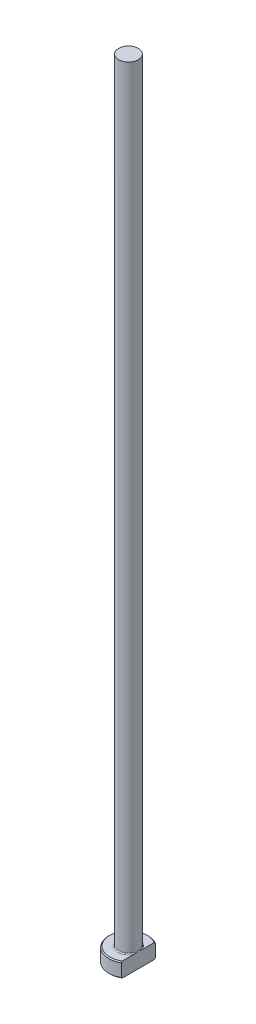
ISO-10303-21;
HEADER;
FILE_DESCRIPTION(('STEP AP214'),'2;1');
FILE_NAME('part.step','',(''),(''),'','','');
FILE_SCHEMA(('AUTOMOTIVE_DESIGN { 1 0 10303 214 1 1 1 1 }'));
ENDSEC;
DATA;
#1=APPLICATION_CONTEXT('core data for automotive mechanical design processes');
#2=APPLICATION_PROTOCOL_DEFINITION('international standard','automotive_design',2000,#1);
#3=PRODUCT_CONTEXT('',#1,'mechanical');
#4=PRODUCT('Part','Part','',(#3));
#5=PRODUCT_RELATED_PRODUCT_CATEGORY('part','',(#4));
#6=PRODUCT_DEFINITION_FORMATION('','',#4);
#7=PRODUCT_DEFINITION_CONTEXT('part definition',#1,'design');
#8=PRODUCT_DEFINITION('design','',#6,#7);
#9=PRODUCT_DEFINITION_SHAPE('','',#8);
#10=(LENGTH_UNIT() NAMED_UNIT(*) SI_UNIT(.MILLI.,.METRE.));
#11=(NAMED_UNIT(*) PLANE_ANGLE_UNIT() SI_UNIT($,.RADIAN.));
#12=(NAMED_UNIT(*) SI_UNIT($,.STERADIAN.) SOLID_ANGLE_UNIT());
#13=UNCERTAINTY_MEASURE_WITH_UNIT(LENGTH_MEASURE(1.E-05),#10,'distance_accuracy_value','');
#14=(GEOMETRIC_REPRESENTATION_CONTEXT(3) GLOBAL_UNCERTAINTY_ASSIGNED_CONTEXT((#13)) GLOBAL_UNIT_ASSIGNED_CONTEXT((#10,
#11,#12)) REPRESENTATION_CONTEXT('',''));
#15=CARTESIAN_POINT('',(0.,0.,0.));
#16=DIRECTION('',(0.,0.,1.));
#17=DIRECTION('',(1.,0.,0.));
#18=AXIS2_PLACEMENT_3D('',#15,#16,#17);
#19=CARTESIAN_POINT('',(0.,0.,0.));
#20=DIRECTION('',(0.,-1.,0.));
#21=DIRECTION('',(0.,0.,-1.));
#22=AXIS2_PLACEMENT_3D('',#19,#20,#21);
#23=PLANE('',#22);
#24=CARTESIAN_POINT('',(0.,0.,0.));
#25=DIRECTION('',(0.,-1.,0.));
#26=DIRECTION('',(0.,0.,-1.));
#27=AXIS2_PLACEMENT_3D('',#24,#25,#26);
#28=CIRCLE('',#27,3.80000000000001);
#29=CARTESIAN_POINT('',(1.99999999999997,0.,3.23109888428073));
#30=VERTEX_POINT('',#29);
#31=CARTESIAN_POINT('',(1.99999999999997,0.,-3.23109888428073));
#32=VERTEX_POINT('',#31);
#33=EDGE_CURVE('E98',#30,#32,#28,.T.);
#34=ORIENTED_EDGE('',*,*,#33,.T.);
#35=DIRECTION('',(0.,0.,1.));
#36=VECTOR('',#35,1.);
#37=CARTESIAN_POINT('',(1.99999999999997,0.,-3.46410161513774));
#38=LINE('',#37,#36);
#39=EDGE_CURVE('E83',#32,#30,#38,.T.);
#40=ORIENTED_EDGE('',*,*,#39,.T.);
#41=EDGE_LOOP('',(#34,#40));
#42=FACE_BOUND('',#41,.T.);
#43=ADVANCED_FACE('F32',(#42),#23,.T.);
#44=CARTESIAN_POINT('',(0.,259.958771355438,0.));
#45=DIRECTION('',(0.,1.,0.));
#46=DIRECTION('',(0.,0.,1.));
#47=AXIS2_PLACEMENT_3D('',#44,#45,#46);
#48=CYLINDRICAL_SURFACE('',#47,3.99999999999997);
#49=CARTESIAN_POINT('',(0.,2.79999999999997,0.));
#50=DIRECTION('',(0.,1.,0.));
#51=DIRECTION('',(0.,0.,1.));
#52=AXIS2_PLACEMENT_3D('',#49,#50,#51);
#53=CIRCLE('',#52,3.99999999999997);
#54=CARTESIAN_POINT('',(1.99999999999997,2.79999999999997,3.46410161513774));
#55=VERTEX_POINT('',#54);
#56=CARTESIAN_POINT('',(1.99999999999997,2.79999999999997,-3.46410161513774));
#57=VERTEX_POINT('',#56);
#58=EDGE_CURVE('E104',#55,#57,#53,.F.);
#59=ORIENTED_EDGE('',*,*,#58,.T.);
#60=DIRECTION('',(0.,-1.,0.));
#61=VECTOR('',#60,1.);
#62=CARTESIAN_POINT('',(1.99999999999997,160.,-3.46410161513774));
#63=LINE('',#62,#61);
#64=CARTESIAN_POINT('',(1.99999999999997,0.199999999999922,-3.46410161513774));
#65=VERTEX_POINT('',#64);
#66=EDGE_CURVE('E183',#57,#65,#63,.T.);
#67=ORIENTED_EDGE('',*,*,#66,.T.);
#68=CARTESIAN_POINT('',(0.,0.199999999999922,0.));
#69=DIRECTION('',(0.,-1.,0.));
#70=DIRECTION('',(0.,0.,-1.));
#71=AXIS2_PLACEMENT_3D('',#68,#69,#70);
#72=CIRCLE('',#71,3.99999999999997);
#73=CARTESIAN_POINT('',(1.99999999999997,0.199999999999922,3.46410161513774));
#74=VERTEX_POINT('',#73);
#75=EDGE_CURVE('E100',#65,#74,#72,.F.);
#76=ORIENTED_EDGE('',*,*,#75,.T.);
#77=DIRECTION('',(0.,-1.,0.));
#78=VECTOR('',#77,1.);
#79=CARTESIAN_POINT('',(1.99999999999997,160.,3.46410161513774));
#80=LINE('',#79,#78);
#81=EDGE_CURVE('E93',#55,#74,#80,.T.);
#82=ORIENTED_EDGE('',*,*,#81,.F.);
#83=EDGE_LOOP('',(#59,#67,#76,#82));
#84=FACE_BOUND('',#83,.T.);
#85=ADVANCED_FACE('F158',(#84),#48,.T.);
#86=CARTESIAN_POINT('',(-3.99999999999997,3.,0.));
#87=DIRECTION('',(0.,1.,0.));
#88=DIRECTION('',(0.,0.,1.));
#89=AXIS2_PLACEMENT_3D('',#86,#87,#88);
#90=PLANE('',#89);
#91=CARTESIAN_POINT('',(0.,3.,0.));
#92=DIRECTION('',(0.,1.,0.));
#93=DIRECTION('',(0.,0.,1.));
#94=AXIS2_PLACEMENT_3D('',#91,#92,#93);
#95=CIRCLE('',#94,3.79999999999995);
#96=CARTESIAN_POINT('',(1.99999999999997,3.,-3.23109888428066));
#97=VERTEX_POINT('',#96);
#98=CARTESIAN_POINT('',(1.99999999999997,3.,3.23109888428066));
#99=VERTEX_POINT('',#98);
#100=EDGE_CURVE('E178',#97,#99,#95,.T.);
#101=ORIENTED_EDGE('',*,*,#100,.T.);
#102=DIRECTION('',(0.,0.,-1.));
#103=VECTOR('',#102,1.);
#104=CARTESIAN_POINT('',(1.99999999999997,3.,0.));
#105=LINE('',#104,#103);
#106=CARTESIAN_POINT('',(1.99999999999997,2.99999999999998,0.916515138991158));
#107=VERTEX_POINT('',#106);
#108=EDGE_CURVE('E57',#99,#107,#105,.T.);
#109=ORIENTED_EDGE('',*,*,#108,.T.);
#110=CARTESIAN_POINT('',(0.,3.,0.));
#111=DIRECTION('',(0.,1.,0.));
#112=DIRECTION('',(0.,0.,1.));
#113=AXIS2_PLACEMENT_3D('',#110,#111,#112);
#114=CIRCLE('',#113,2.19999999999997);
#115=CARTESIAN_POINT('',(1.99999999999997,2.99999999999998,-0.9165151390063));
#116=VERTEX_POINT('',#115);
#117=EDGE_CURVE('E107',#107,#116,#114,.F.);
#118=ORIENTED_EDGE('',*,*,#117,.T.);
#119=EDGE_CURVE('E136',#116,#97,#105,.T.);
#120=ORIENTED_EDGE('',*,*,#119,.T.);
#121=EDGE_LOOP('',(#101,#109,#118,#120));
#122=FACE_BOUND('',#121,.T.);
#123=ADVANCED_FACE('F147',(#122),#90,.T.);
#124=CARTESIAN_POINT('',(0.,3.,0.));
#125=DIRECTION('',(0.,-1.,0.));
#126=DIRECTION('',(0.,0.,-1.));
#127=AXIS2_PLACEMENT_3D('',#124,#125,#126);
#128=CONICAL_SURFACE('',#127,3.79999999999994,0.785398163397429);
#129=ORIENTED_EDGE('',*,*,#58,.F.);
#130=CARTESIAN_POINT('',(1.99999999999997,-1.08095467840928,7.62295524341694));
#131=CARTESIAN_POINT('',(1.99999999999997,-0.913887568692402,7.45022392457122));
#132=CARTESIAN_POINT('',(1.99999999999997,-0.746999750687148,7.27731861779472));
#133=CARTESIAN_POINT('',(1.99999999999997,-0.413688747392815,6.93105655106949));
#134=CARTESIAN_POINT('',(1.99999999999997,-0.247265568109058,6.75769978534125));
#135=CARTESIAN_POINT('',(1.99999999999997,0.0850908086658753,6.41034692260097));
#136=CARTESIAN_POINT('',(1.99999999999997,0.251023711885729,6.23635054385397));
#137=CARTESIAN_POINT('',(1.99999999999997,0.582155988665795,5.88766284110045));
#138=CARTESIAN_POINT('',(1.99999999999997,0.747355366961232,5.71297152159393));
#139=CARTESIAN_POINT('',(1.99999999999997,1.07353855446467,5.36616839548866));
#140=CARTESIAN_POINT('',(1.99999999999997,1.23454099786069,5.194074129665));
#141=CARTESIAN_POINT('',(1.99999999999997,1.5553410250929,4.84876663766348));
#142=CARTESIAN_POINT('',(1.99999999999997,1.71513861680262,4.67555341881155));
#143=CARTESIAN_POINT('',(1.99999999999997,2.03306183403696,4.32766569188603));
#144=CARTESIAN_POINT('',(1.99999999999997,2.19118781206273,4.15299150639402));
#145=CARTESIAN_POINT('',(1.99999999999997,2.50513944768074,3.80159134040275));
#146=CARTESIAN_POINT('',(1.99999999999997,2.6609651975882,3.62486544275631));
#147=CARTESIAN_POINT('',(1.99999999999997,2.90974646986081,3.33722425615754));
#148=CARTESIAN_POINT('',(1.99999999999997,3.00376148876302,3.22722645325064));
#149=CARTESIAN_POINT('',(1.99999999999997,3.19011825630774,3.00579987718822));
#150=CARTESIAN_POINT('',(1.99999999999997,3.28245983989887,2.89437096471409));
#151=CARTESIAN_POINT('',(1.99999999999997,3.46586188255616,2.66849662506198));
#152=CARTESIAN_POINT('',(1.99999999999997,3.55689849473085,2.55403176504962));
#153=CARTESIAN_POINT('',(1.99999999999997,3.73578809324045,2.32266819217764));
#154=CARTESIAN_POINT('',(1.99999999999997,3.82364184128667,2.20577007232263));
#155=CARTESIAN_POINT('',(1.99999999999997,3.99612756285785,1.96688707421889));
#156=CARTESIAN_POINT('',(1.99999999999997,4.08069035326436,1.84485190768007));
#157=CARTESIAN_POINT('',(1.99999999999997,4.24300264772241,1.59599329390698));
#158=CARTESIAN_POINT('',(1.99999999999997,4.32074277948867,1.46916359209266));
#159=CARTESIAN_POINT('',(1.99999999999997,4.42869763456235,1.27510066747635));
#160=CARTESIAN_POINT('',(1.99999999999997,4.46305374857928,1.21018943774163));
#161=CARTESIAN_POINT('',(1.99999999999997,4.52837146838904,1.07868835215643));
#162=CARTESIAN_POINT('',(1.99999999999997,4.55933245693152,1.01209819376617));
#163=CARTESIAN_POINT('',(1.99999999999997,4.64566860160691,0.809894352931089));
#164=CARTESIAN_POINT('',(1.99999999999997,4.69478214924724,0.67136024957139));
#165=CARTESIAN_POINT('',(1.99999999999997,4.74794829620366,0.463657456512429));
#166=CARTESIAN_POINT('',(1.99999999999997,4.76205065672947,0.397033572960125));
#167=CARTESIAN_POINT('',(1.99999999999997,4.7839037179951,0.262728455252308));
#168=CARTESIAN_POINT('',(1.99999999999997,4.79165498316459,0.195047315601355));
#169=CARTESIAN_POINT('',(1.99999999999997,4.80025690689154,0.0594528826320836));
#170=CARTESIAN_POINT('',(1.99999999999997,4.80112894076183,-0.00845903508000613));
#171=CARTESIAN_POINT('',(1.99999999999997,4.79596585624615,-0.144020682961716));
#172=CARTESIAN_POINT('',(1.99999999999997,4.7899301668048,-0.211670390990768));
#173=CARTESIAN_POINT('',(1.99999999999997,4.77145363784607,-0.34548399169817));
#174=CARTESIAN_POINT('',(1.99999999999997,4.75906777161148,-0.411655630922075));
#175=CARTESIAN_POINT('',(1.99999999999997,4.72866360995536,-0.542678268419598));
#176=CARTESIAN_POINT('',(1.99999999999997,4.71064463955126,-0.607529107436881));
#177=CARTESIAN_POINT('',(1.99999999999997,4.66972939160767,-0.736064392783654));
#178=CARTESIAN_POINT('',(1.99999999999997,4.6468056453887,-0.799739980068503));
#179=CARTESIAN_POINT('',(1.99999999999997,4.59700147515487,-0.925489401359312));
#180=CARTESIAN_POINT('',(1.99999999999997,4.57012185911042,-0.98756355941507));
#181=CARTESIAN_POINT('',(1.99999999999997,4.48443518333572,-1.17209020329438));
#182=CARTESIAN_POINT('',(1.99999999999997,4.42077407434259,-1.29228210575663));
#183=CARTESIAN_POINT('',(1.99999999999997,4.28502644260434,-1.52785770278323));
#184=CARTESIAN_POINT('',(1.99999999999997,4.21292931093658,-1.64323509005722));
#185=CARTESIAN_POINT('',(1.99999999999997,4.0628151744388,-1.87069387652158));
#186=CARTESIAN_POINT('',(1.99999999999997,3.98477595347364,-1.98276048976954));
#187=CARTESIAN_POINT('',(1.99999999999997,3.82481971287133,-2.20397837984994));
#188=CARTESIAN_POINT('',(1.99999999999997,3.74290465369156,-2.31313108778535));
#189=CARTESIAN_POINT('',(1.99999999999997,3.57517222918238,-2.5306854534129));
#190=CARTESIAN_POINT('',(1.99999999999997,3.48931769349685,-2.63905831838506));
#191=CARTESIAN_POINT('',(1.99999999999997,3.31548151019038,-2.85409686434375));
#192=CARTESIAN_POINT('',(1.99999999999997,3.22749963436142,-2.96076236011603));
#193=CARTESIAN_POINT('',(1.99999999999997,3.05015030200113,-3.17249211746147));
#194=CARTESIAN_POINT('',(1.99999999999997,2.96078672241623,-3.27755963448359));
#195=CARTESIAN_POINT('',(1.99999999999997,2.78082366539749,-3.48663191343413));
#196=CARTESIAN_POINT('',(1.99999999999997,2.69022416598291,-3.59063665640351));
#197=CARTESIAN_POINT('',(1.99999999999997,2.4479673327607,-3.86612439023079));
#198=CARTESIAN_POINT('',(1.99999999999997,2.29545972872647,-4.03685912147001));
#199=CARTESIAN_POINT('',(1.99999999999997,1.98858070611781,-4.37664803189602));
#200=CARTESIAN_POINT('',(1.99999999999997,1.8342092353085,-4.54570216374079));
#201=CARTESIAN_POINT('',(1.99999999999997,1.52396102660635,-4.88271638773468));
#202=CARTESIAN_POINT('',(1.99999999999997,1.3680830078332,-5.05067529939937));
#203=CARTESIAN_POINT('',(1.99999999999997,1.05530513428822,-5.38563883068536));
#204=CARTESIAN_POINT('',(1.99999999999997,0.898405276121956,-5.55264344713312));
#205=CARTESIAN_POINT('',(1.99999999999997,0.590290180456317,-5.87905385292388));
#206=CARTESIAN_POINT('',(1.99999999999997,0.439106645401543,-6.03848959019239));
#207=CARTESIAN_POINT('',(1.99999999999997,0.136164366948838,-6.356814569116));
#208=CARTESIAN_POINT('',(1.99999999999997,-0.0155943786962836,-6.51570380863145));
#209=CARTESIAN_POINT('',(1.99999999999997,-0.31940498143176,-6.83286192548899));
#210=CARTESIAN_POINT('',(1.99999999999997,-0.471456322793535,-6.99113129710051));
#211=CARTESIAN_POINT('',(1.99999999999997,-0.77593964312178,-7.30730102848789));
#212=CARTESIAN_POINT('',(1.99999999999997,-0.928371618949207,-7.46520139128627));
#213=CARTESIAN_POINT('',(1.99999999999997,-1.08095467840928,-7.62295524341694));
#214=B_SPLINE_CURVE_WITH_KNOTS('',3,(#130,#131,#132,#133,#134,#135,#136,#137,#138,#139,#140,
#141,#142,#143,#144,#145,#146,#147,#148,#149,#150,#151,#152,#153,#154,#155,#156,#157,#158,#159,
#160,#161,#162,#163,#164,#165,#166,#167,#168,#169,#170,#171,#172,#173,#174,#175,#176,#177,#178,
#179,#180,#181,#182,#183,#184,#185,#186,#187,#188,#189,#190,#191,#192,#193,#194,#195,#196,#197,
#198,#199,#200,#201,#202,#203,#204,#205,#206,#207,#208,#209,#210,#211,#212,#213),.UNSPECIFIED.,
.F.,.F.,(4,2,2,2,2,2,2,2,2,2,2,2,2,2,2,2,2,2,2,2,2,2,2,2,2,2,2,2,2,2,2,2,2,2,2,2,2,2,2,2,2,4),
(0.,0.720921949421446,1.44185317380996,2.1631532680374,2.88444869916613,3.59144103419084,
4.29842874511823,5.005264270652,5.712071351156,6.14616174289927,6.58029471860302,
7.01901494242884,7.45762947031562,7.90290456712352,8.34878206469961,8.56901415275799,
8.7892862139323,9.22814472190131,9.43219512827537,9.63622739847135,9.8396254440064,
10.0430403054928,10.2447232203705,10.4464303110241,10.6492980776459,10.8521244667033,
11.259558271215,11.6675100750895,12.0770700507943,12.4864250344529,12.901167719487,
13.3159550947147,13.7297367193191,14.1435257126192,14.8302935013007,15.5170805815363,
16.2045145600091,16.8919508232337,17.5511045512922,18.2102608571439,18.86868195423,
19.5270976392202),.UNSPECIFIED.);
#215=EDGE_CURVE('E135',#55,#99,#214,.T.);
#216=ORIENTED_EDGE('',*,*,#215,.T.);
#217=ORIENTED_EDGE('',*,*,#100,.F.);
#218=EDGE_CURVE('E127',#97,#57,#214,.T.);
#219=ORIENTED_EDGE('',*,*,#218,.T.);
#220=EDGE_LOOP('',(#129,#216,#217,#219));
#221=FACE_BOUND('',#220,.T.);
#222=ADVANCED_FACE('F143',(#221),#128,.T.);
#223=CARTESIAN_POINT('',(0.,0.199999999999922,0.));
#224=DIRECTION('',(0.,1.,0.));
#225=DIRECTION('',(0.,0.,1.));
#226=AXIS2_PLACEMENT_3D('',#223,#224,#225);
#227=CONICAL_SURFACE('',#226,3.99999999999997,0.785398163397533);
#228=ORIENTED_EDGE('',*,*,#75,.F.);
#229=CARTESIAN_POINT('',(1.99999999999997,4.08095467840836,-7.62295524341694));
#230=CARTESIAN_POINT('',(1.99999999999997,3.91388756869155,-7.45022392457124));
#231=CARTESIAN_POINT('',(1.99999999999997,3.74699975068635,-7.27731861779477));
#232=CARTESIAN_POINT('',(1.99999999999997,3.41368874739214,-6.9310565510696));
#233=CARTESIAN_POINT('',(1.99999999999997,3.24726556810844,-6.75769978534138));
#234=CARTESIAN_POINT('',(1.99999999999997,2.91490919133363,-6.41034692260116));
#235=CARTESIAN_POINT('',(1.99999999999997,2.74897628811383,-6.23635054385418));
#236=CARTESIAN_POINT('',(1.99999999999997,2.41784401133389,-5.88766284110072));
#237=CARTESIAN_POINT('',(1.99999999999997,2.25264463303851,-5.71297152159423));
#238=CARTESIAN_POINT('',(1.99999999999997,1.92646144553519,-5.36616839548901));
#239=CARTESIAN_POINT('',(1.99999999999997,1.76545900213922,-5.19407412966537));
#240=CARTESIAN_POINT('',(1.99999999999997,1.44465897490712,-4.84876663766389));
#241=CARTESIAN_POINT('',(1.99999999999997,1.28486138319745,-4.67555341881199));
#242=CARTESIAN_POINT('',(1.99999999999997,0.966938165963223,-4.32766569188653));
#243=CARTESIAN_POINT('',(1.99999999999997,0.808812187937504,-4.15299150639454));
#244=CARTESIAN_POINT('',(1.99999999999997,0.494860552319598,-3.80159134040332));
#245=CARTESIAN_POINT('',(1.99999999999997,0.339034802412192,-3.62486544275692));
#246=CARTESIAN_POINT('',(1.99999999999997,0.0902535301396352,-3.33722425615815));
#247=CARTESIAN_POINT('',(1.99999999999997,-0.00376148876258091,-3.22722645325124));
#248=CARTESIAN_POINT('',(1.99999999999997,-0.190118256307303,-3.00579987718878));
#249=CARTESIAN_POINT('',(1.99999999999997,-0.282459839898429,-2.89437096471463));
#250=CARTESIAN_POINT('',(1.99999999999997,-0.46586188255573,-2.66849662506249));
#251=CARTESIAN_POINT('',(1.99999999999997,-0.556898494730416,-2.55403176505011));
#252=CARTESIAN_POINT('',(1.99999999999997,-0.73578809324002,-2.3226681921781));
#253=CARTESIAN_POINT('',(1.99999999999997,-0.823641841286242,-2.20577007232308));
#254=CARTESIAN_POINT('',(1.99999999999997,-0.99612756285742,-1.9668870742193));
#255=CARTESIAN_POINT('',(1.99999999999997,-1.08069035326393,-1.84485190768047));
#256=CARTESIAN_POINT('',(1.99999999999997,-1.24300264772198,-1.59599329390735));
#257=CARTESIAN_POINT('',(1.99999999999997,-1.32074277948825,-1.46916359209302));
#258=CARTESIAN_POINT('',(1.99999999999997,-1.42869763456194,-1.27510066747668));
#259=CARTESIAN_POINT('',(1.99999999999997,-1.46305374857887,-1.21018943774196));
#260=CARTESIAN_POINT('',(1.99999999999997,-1.52837146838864,-1.07868835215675));
#261=CARTESIAN_POINT('',(1.99999999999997,-1.55933245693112,-1.01209819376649));
#262=CARTESIAN_POINT('',(1.99999999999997,-1.64566860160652,-0.809894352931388));
#263=CARTESIAN_POINT('',(1.99999999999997,-1.69478214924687,-0.671360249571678));
#264=CARTESIAN_POINT('',(1.99999999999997,-1.7479482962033,-0.463657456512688));
#265=CARTESIAN_POINT('',(1.99999999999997,-1.76205065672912,-0.397033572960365));
#266=CARTESIAN_POINT('',(1.99999999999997,-1.78390371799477,-0.262728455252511));
#267=CARTESIAN_POINT('',(1.99999999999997,-1.79165498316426,-0.195047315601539));
#268=CARTESIAN_POINT('',(1.99999999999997,-1.80025690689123,-0.0594528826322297));
#269=CARTESIAN_POINT('',(1.99999999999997,-1.80112894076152,0.00845903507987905));
#270=CARTESIAN_POINT('',(1.99999999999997,-1.79596585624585,0.144020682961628));
#271=CARTESIAN_POINT('',(1.99999999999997,-1.78993016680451,0.2116703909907));
#272=CARTESIAN_POINT('',(1.99999999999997,-1.77145363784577,0.345483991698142));
#273=CARTESIAN_POINT('',(1.99999999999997,-1.75906777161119,0.411655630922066));
#274=CARTESIAN_POINT('',(1.99999999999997,-1.72866360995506,0.542678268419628));
#275=CARTESIAN_POINT('',(1.99999999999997,-1.71064463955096,0.607529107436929));
#276=CARTESIAN_POINT('',(1.99999999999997,-1.66972939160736,0.736064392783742));
#277=CARTESIAN_POINT('',(1.99999999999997,-1.64680564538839,0.799739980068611));
#278=CARTESIAN_POINT('',(1.99999999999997,-1.59700147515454,0.925489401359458));
#279=CARTESIAN_POINT('',(1.99999999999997,-1.57012185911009,0.987563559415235));
#280=CARTESIAN_POINT('',(1.99999999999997,-1.48443518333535,1.17209020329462));
#281=CARTESIAN_POINT('',(1.99999999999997,-1.4207740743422,1.29228210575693));
#282=CARTESIAN_POINT('',(1.99999999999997,-1.28502644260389,1.52785770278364));
#283=CARTESIAN_POINT('',(1.99999999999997,-1.2129293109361,1.64323509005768));
#284=CARTESIAN_POINT('',(1.99999999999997,-1.06281517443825,1.87069387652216));
#285=CARTESIAN_POINT('',(1.99999999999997,-0.984775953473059,1.98276048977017));
#286=CARTESIAN_POINT('',(1.99999999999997,-0.824819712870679,2.20397837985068));
#287=CARTESIAN_POINT('',(1.99999999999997,-0.74290465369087,2.31313108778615));
#288=CARTESIAN_POINT('',(1.99999999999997,-0.575172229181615,2.5306854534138));
#289=CARTESIAN_POINT('',(1.99999999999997,-0.489317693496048,2.63905831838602));
#290=CARTESIAN_POINT('',(1.99999999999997,-0.315481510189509,2.85409686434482));
#291=CARTESIAN_POINT('',(1.99999999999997,-0.227499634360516,2.96076236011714));
#292=CARTESIAN_POINT('',(1.99999999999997,-0.0501503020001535,3.1724921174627));
#293=CARTESIAN_POINT('',(1.99999999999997,0.0392132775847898,3.27755963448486));
#294=CARTESIAN_POINT('',(1.99999999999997,0.219176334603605,3.48663191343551));
#295=CARTESIAN_POINT('',(1.99999999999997,0.309775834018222,3.59063665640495));
#296=CARTESIAN_POINT('',(1.99999999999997,0.55203266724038,3.86612439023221));
#297=CARTESIAN_POINT('',(1.99999999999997,0.704540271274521,4.03685912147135));
#298=CARTESIAN_POINT('',(1.99999999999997,1.011419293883,4.37664803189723));
#299=CARTESIAN_POINT('',(1.99999999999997,1.16579076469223,4.54570216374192));
#300=CARTESIAN_POINT('',(1.99999999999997,1.4760389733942,4.88271638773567));
#301=CARTESIAN_POINT('',(1.99999999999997,1.63191699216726,5.0506752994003));
#302=CARTESIAN_POINT('',(1.99999999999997,1.94469486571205,5.38563883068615));
#303=CARTESIAN_POINT('',(1.99999999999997,2.10159472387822,5.55264344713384));
#304=CARTESIAN_POINT('',(1.99999999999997,2.40970981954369,5.87905385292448));
#305=CARTESIAN_POINT('',(1.99999999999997,2.56089335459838,6.03848959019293));
#306=CARTESIAN_POINT('',(1.99999999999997,2.86383563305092,6.35681456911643));
#307=CARTESIAN_POINT('',(1.99999999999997,3.01559437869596,6.51570380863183));
#308=CARTESIAN_POINT('',(1.99999999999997,3.31940498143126,6.83286192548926));
#309=CARTESIAN_POINT('',(1.99999999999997,3.47145632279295,6.99113129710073));
#310=CARTESIAN_POINT('',(1.99999999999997,3.77593964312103,7.307301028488));
#311=CARTESIAN_POINT('',(1.99999999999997,3.92837161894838,7.46520139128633));
#312=CARTESIAN_POINT('',(1.99999999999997,4.08095467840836,7.62295524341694));
#313=B_SPLINE_CURVE_WITH_KNOTS('',3,(#229,#230,#231,#232,#233,#234,#235,#236,#237,#238,#239,
#240,#241,#242,#243,#244,#245,#246,#247,#248,#249,#250,#251,#252,#253,#254,#255,#256,#257,#258,
#259,#260,#261,#262,#263,#264,#265,#266,#267,#268,#269,#270,#271,#272,#273,#274,#275,#276,#277,
#278,#279,#280,#281,#282,#283,#284,#285,#286,#287,#288,#289,#290,#291,#292,#293,#294,#295,#296,
#297,#298,#299,#300,#301,#302,#303,#304,#305,#306,#307,#308,#309,#310,#311,#312),.UNSPECIFIED.,
.F.,.F.,(4,2,2,2,2,2,2,2,2,2,2,2,2,2,2,2,2,2,2,2,2,2,2,2,2,2,2,2,2,2,2,2,2,2,2,2,2,2,2,2,2,4),
(0.,0.720921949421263,1.4418531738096,2.16315326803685,2.8844486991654,3.59144103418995,
4.29842874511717,5.00526427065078,5.71207135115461,6.14616174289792,6.58029471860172,
7.01901494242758,7.4576294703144,7.90290456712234,8.34878206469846,8.56901415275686,
8.78928621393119,9.22814472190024,9.43219512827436,9.6362273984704,9.83962544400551,
10.043040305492,10.2447232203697,10.4464303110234,10.6492980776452,10.8521244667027,
11.2595582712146,11.6675100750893,12.0770700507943,12.4864250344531,12.9011677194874,
13.3159550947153,13.7297367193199,14.1435257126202,14.8302935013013,15.5170805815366,
16.204514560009,16.8919508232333,17.5511045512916,18.2102608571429,18.8686819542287,
19.5270976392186),.UNSPECIFIED.);
#314=EDGE_CURVE('E86',#65,#32,#313,.T.);
#315=ORIENTED_EDGE('',*,*,#314,.T.);
#316=ORIENTED_EDGE('',*,*,#33,.F.);
#317=EDGE_CURVE('E89',#30,#74,#313,.T.);
#318=ORIENTED_EDGE('',*,*,#317,.T.);
#319=EDGE_LOOP('',(#228,#315,#316,#318));
#320=FACE_BOUND('',#319,.T.);
#321=ADVANCED_FACE('F97',(#320),#227,.T.);
#322=CARTESIAN_POINT('',(0.,3.19999999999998,0.));
#323=DIRECTION('',(0.,1.,0.));
#324=DIRECTION('',(0.,0.,1.));
#325=AXIS2_PLACEMENT_3D('',#322,#323,#324);
#326=TOROIDAL_SURFACE('',#325,2.19999999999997,0.2);
#327=CARTESIAN_POINT('',(1.99999999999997,3.19999999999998,0.));
#328=CARTESIAN_POINT('',(1.99999999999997,3.20000050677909,1.13930257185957E-10));
#329=CARTESIAN_POINT('',(1.99999999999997,3.20000101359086,-1.46766790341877E-07));
#330=CARTESIAN_POINT('',(1.99999999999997,3.20000197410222,-5.82067439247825E-07));
#331=CARTESIAN_POINT('',(1.99999999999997,3.20000242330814,-8.77873003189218E-07));
#332=CARTESIAN_POINT('',(1.99999999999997,3.20000333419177,-1.58424512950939E-06));
#333=CARTESIAN_POINT('',(1.99999999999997,3.20000378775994,-2.00534281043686E-06));
#334=CARTESIAN_POINT('',(1.99999999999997,3.20000462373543,-2.89558838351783E-06));
#335=CARTESIAN_POINT('',(1.99999999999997,3.20000500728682,-3.3637232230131E-06));
#336=CARTESIAN_POINT('',(1.99999999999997,3.20000636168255,-5.10887545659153E-06));
#337=CARTESIAN_POINT('',(1.99999999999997,3.2000072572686,-6.44597273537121E-06));
#338=CARTESIAN_POINT('',(1.99999999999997,3.20000879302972,-9.14926709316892E-06));
#339=CARTESIAN_POINT('',(1.99999999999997,3.20000944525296,-1.05089714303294E-05));
#340=CARTESIAN_POINT('',(1.99999999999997,3.20001204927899,-1.60555879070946E-05));
#341=CARTESIAN_POINT('',(1.99999999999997,3.20001390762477,-2.02908746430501E-05));
#342=CARTESIAN_POINT('',(1.99999999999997,3.20001676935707,-2.84438492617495E-05));
#343=CARTESIAN_POINT('',(1.99999999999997,3.2000178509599,-3.23343257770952E-05));
#344=CARTESIAN_POINT('',(1.99999999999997,3.20002551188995,-6.06027142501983E-05));
#345=CARTESIAN_POINT('',(1.99999999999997,3.20003111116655,-8.51991843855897E-05));
#346=CARTESIAN_POINT('',(1.99999999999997,3.20005559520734,-0.000181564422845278));
#347=CARTESIAN_POINT('',(1.99999999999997,3.20007914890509,-0.00025209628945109));
#348=CARTESIAN_POINT('',(1.99999999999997,3.20017002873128,-0.000529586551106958));
#349=CARTESIAN_POINT('',(1.99999999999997,3.20023415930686,-0.000737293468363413));
#350=CARTESIAN_POINT('',(1.99999999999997,3.20048926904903,-0.00155657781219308));
#351=CARTESIAN_POINT('',(1.99999999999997,3.20068414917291,-0.00216722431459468));
#352=CARTESIAN_POINT('',(1.99999999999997,3.20148805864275,-0.00469384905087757));
#353=CARTESIAN_POINT('',(1.99999999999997,3.20209226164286,-0.00661098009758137));
#354=CARTESIAN_POINT('',(1.99999999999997,3.20822779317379,-0.026069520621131));
#355=CARTESIAN_POINT('',(1.99999999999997,3.21378174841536,-0.0436057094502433));
#356=CARTESIAN_POINT('',(1.99999999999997,3.22462834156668,-0.0780127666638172));
#357=CARTESIAN_POINT('',(1.99999999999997,3.2299227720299,-0.0948831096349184));
#358=CARTESIAN_POINT('',(1.99999999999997,3.24110477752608,-0.130713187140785));
#359=CARTESIAN_POINT('',(1.99999999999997,3.24698536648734,-0.149675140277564));
#360=CARTESIAN_POINT('',(1.99999999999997,3.2586983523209,-0.187834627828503));
#361=CARTESIAN_POINT('',(1.99999999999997,3.26452957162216,-0.207032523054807));
#362=CARTESIAN_POINT('',(1.99999999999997,3.27861584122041,-0.254071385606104));
#363=CARTESIAN_POINT('',(1.99999999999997,3.28678835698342,-0.281937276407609));
#364=CARTESIAN_POINT('',(1.99999999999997,3.30249503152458,-0.337115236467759));
#365=CARTESIAN_POINT('',(1.99999999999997,3.31003989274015,-0.36442425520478));
#366=CARTESIAN_POINT('',(1.99999999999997,3.32554795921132,-0.422841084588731));
#367=CARTESIAN_POINT('',(1.99999999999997,3.33343288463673,-0.453970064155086));
#368=CARTESIAN_POINT('',(1.99999999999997,3.34833120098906,-0.516667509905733));
#369=CARTESIAN_POINT('',(1.99999999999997,3.3553379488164,-0.548237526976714));
#370=CARTESIAN_POINT('',(1.99999999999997,3.37554978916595,-0.647984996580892));
#371=CARTESIAN_POINT('',(1.99999999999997,3.38665117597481,-0.716635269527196));
#372=CARTESIAN_POINT('',(1.99999999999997,3.39785773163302,-0.832445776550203));
#373=CARTESIAN_POINT('',(1.99999999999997,3.40036304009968,-0.879345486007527));
#374=CARTESIAN_POINT('',(1.99999999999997,3.3997602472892,-0.94923898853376));
#375=CARTESIAN_POINT('',(1.99999999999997,3.39886048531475,-0.972248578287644));
#376=CARTESIAN_POINT('',(1.99999999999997,3.39534463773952,-1.01812773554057));
#377=CARTESIAN_POINT('',(1.99999999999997,3.39273014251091,-1.04099741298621));
#378=CARTESIAN_POINT('',(1.99999999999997,3.38623968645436,-1.08102660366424));
#379=CARTESIAN_POINT('',(1.99999999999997,3.38280841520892,-1.09825717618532));
#380=CARTESIAN_POINT('',(1.99999999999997,3.37442567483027,-1.13243508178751));
#381=CARTESIAN_POINT('',(1.99999999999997,3.36946777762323,-1.14938089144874));
#382=CARTESIAN_POINT('',(1.99999999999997,3.35764172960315,-1.18276398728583));
#383=CARTESIAN_POINT('',(1.99999999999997,3.3507581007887,-1.19919590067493));
#384=CARTESIAN_POINT('',(1.99999999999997,3.33462082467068,-1.23083581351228));
#385=CARTESIAN_POINT('',(1.99999999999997,3.32537783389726,-1.24604892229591));
#386=CARTESIAN_POINT('',(1.99999999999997,3.30929159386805,-1.26715296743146));
#387=CARTESIAN_POINT('',(1.99999999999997,3.30356769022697,-1.27389441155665));
#388=CARTESIAN_POINT('',(1.99999999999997,3.29128925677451,-1.28659894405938));
#389=CARTESIAN_POINT('',(1.99999999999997,3.28473413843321,-1.2925614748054));
#390=CARTESIAN_POINT('',(1.99999999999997,3.27066594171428,-1.30346436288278));
#391=CARTESIAN_POINT('',(1.99999999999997,3.26314132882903,-1.30839014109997));
#392=CARTESIAN_POINT('',(1.99999999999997,3.24727957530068,-1.31668687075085));
#393=CARTESIAN_POINT('',(1.99999999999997,3.23894498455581,-1.32006252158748));
#394=CARTESIAN_POINT('',(1.99999999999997,3.22424089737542,-1.3241557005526));
#395=CARTESIAN_POINT('',(1.99999999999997,3.21800630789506,-1.32536112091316));
#396=CARTESIAN_POINT('',(1.99999999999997,3.20542266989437,-1.32669615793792));
#397=CARTESIAN_POINT('',(1.99999999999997,3.19907368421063,-1.32682634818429));
#398=CARTESIAN_POINT('',(1.99999999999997,3.18645152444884,-1.32599950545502));
#399=CARTESIAN_POINT('',(1.99999999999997,3.18017831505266,-1.32504300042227));
#400=CARTESIAN_POINT('',(1.99999999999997,3.16787181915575,-1.32212308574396));
#401=CARTESIAN_POINT('',(1.99999999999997,3.16183869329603,-1.3201590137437));
#402=CARTESIAN_POINT('',(1.99999999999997,3.14844260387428,-1.3146656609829));
#403=CARTESIAN_POINT('',(1.99999999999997,3.14119825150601,-1.31084826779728));
#404=CARTESIAN_POINT('',(1.99999999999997,3.12742328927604,-1.30209252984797));
#405=CARTESIAN_POINT('',(1.99999999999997,3.12089414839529,-1.2971519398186));
#406=CARTESIAN_POINT('',(1.99999999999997,3.10554761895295,-1.28382084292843));
#407=CARTESIAN_POINT('',(1.99999999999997,3.09717242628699,-1.27492468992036));
#408=CARTESIAN_POINT('',(1.99999999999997,3.08188323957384,-1.25597903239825));
#409=CARTESIAN_POINT('',(1.99999999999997,3.07497120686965,-1.24592800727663));
#410=CARTESIAN_POINT('',(1.99999999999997,3.05771073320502,-1.21734573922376));
#411=CARTESIAN_POINT('',(1.99999999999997,3.04862251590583,-1.19806017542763));
#412=CARTESIAN_POINT('',(1.99999999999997,3.03323781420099,-1.15830155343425));
#413=CARTESIAN_POINT('',(1.99999999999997,3.02696471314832,-1.13782009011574));
#414=CARTESIAN_POINT('',(1.99999999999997,3.0165915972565,-1.09607450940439));
#415=CARTESIAN_POINT('',(1.99999999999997,3.0125177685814,-1.07480405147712));
#416=CARTESIAN_POINT('',(1.99999999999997,3.00618909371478,-1.03196822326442));
#417=CARTESIAN_POINT('',(1.99999999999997,3.00393768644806,-1.01040237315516));
#418=CARTESIAN_POINT('',(1.99999999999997,2.99950887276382,-0.94694819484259));
#419=CARTESIAN_POINT('',(1.99999999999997,2.99937097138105,-0.904921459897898));
#420=CARTESIAN_POINT('',(1.99999999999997,3.00391139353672,-0.800067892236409));
#421=CARTESIAN_POINT('',(1.99999999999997,3.01103947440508,-0.7373784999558));
#422=CARTESIAN_POINT('',(1.99999999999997,3.0310998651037,-0.611444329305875));
#423=CARTESIAN_POINT('',(1.99999999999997,3.04417074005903,-0.548223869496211));
#424=CARTESIAN_POINT('',(1.99999999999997,3.06920011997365,-0.442888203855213));
#425=CARTESIAN_POINT('',(1.99999999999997,3.08016343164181,-0.40052705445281));
#426=CARTESIAN_POINT('',(1.99999999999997,3.10315303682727,-0.316588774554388));
#427=CARTESIAN_POINT('',(1.99999999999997,3.11516655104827,-0.275008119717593));
#428=CARTESIAN_POINT('',(1.99999999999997,3.13853403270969,-0.196672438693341));
#429=CARTESIAN_POINT('',(1.99999999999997,3.14981294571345,-0.159894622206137));
#430=CARTESIAN_POINT('',(1.99999999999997,3.17316886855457,-0.0849211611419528));
#431=CARTESIAN_POINT('',(1.99999999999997,3.1852595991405,-0.0467297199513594));
#432=CARTESIAN_POINT('',(1.99999999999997,3.19790869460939,-0.00660765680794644));
#433=CARTESIAN_POINT('',(1.99999999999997,3.19851400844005,-0.00468723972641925));
#434=CARTESIAN_POINT('',(1.99999999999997,3.19931818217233,-0.00215985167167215));
#435=CARTESIAN_POINT('',(1.99999999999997,3.19951225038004,-0.00155173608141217));
#436=CARTESIAN_POINT('',(1.99999999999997,3.19976637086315,-0.000735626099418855));
#437=CARTESIAN_POINT('',(1.99999999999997,3.19983030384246,-0.000528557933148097));
#438=CARTESIAN_POINT('',(1.99999999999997,3.1999209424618,-0.000251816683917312));
#439=CARTESIAN_POINT('',(1.99999999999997,3.19994446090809,-0.000181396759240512));
#440=CARTESIAN_POINT('',(1.99999999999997,3.19996891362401,-8.51622335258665E-05));
#441=CARTESIAN_POINT('',(1.99999999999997,3.19997450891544,-6.05824642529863E-05));
#442=CARTESIAN_POINT('',(1.99999999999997,3.19998216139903,-3.23308900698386E-05));
#443=CARTESIAN_POINT('',(1.99999999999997,3.19998324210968,-2.8441435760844E-05));
#444=CARTESIAN_POINT('',(1.99999999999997,3.19998610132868,-2.02904708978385E-05));
#445=CARTESIAN_POINT('',(1.99999999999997,3.19998795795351,-1.60561197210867E-05));
#446=CARTESIAN_POINT('',(1.99999999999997,3.19999055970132,-1.05104410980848E-05));
#447=CARTESIAN_POINT('',(1.99999999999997,3.19999121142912,-9.15081310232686E-06));
#448=CARTESIAN_POINT('',(1.99999999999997,3.19999274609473,-6.44758190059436E-06));
#449=CARTESIAN_POINT('',(1.99999999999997,3.19999364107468,-5.11046368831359E-06));
#450=CARTESIAN_POINT('',(1.99999999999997,3.19999499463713,-3.36517633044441E-06));
#451=CARTESIAN_POINT('',(1.99999999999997,3.19999537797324,-2.89697952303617E-06));
#452=CARTESIAN_POINT('',(1.99999999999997,3.19999621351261,-2.00657123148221E-06));
#453=CARTESIAN_POINT('',(1.99999999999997,3.19999666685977,-1.58537194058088E-06));
#454=CARTESIAN_POINT('',(1.99999999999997,3.19999757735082,-8.78757202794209E-07));
#455=CARTESIAN_POINT('',(1.99999999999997,3.19999802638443,-5.82817881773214E-07));
#456=CARTESIAN_POINT('',(1.99999999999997,3.19999898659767,-1.47186730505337E-07));
#457=CARTESIAN_POINT('',(1.99999999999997,3.1999994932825,-1.13916400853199E-10));
#458=CARTESIAN_POINT('',(1.99999999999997,3.19999999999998,0.));
#459=B_SPLINE_CURVE_WITH_KNOTS('',3,(#327,#328,#329,#330,#331,#332,#333,#334,#335,#336,#337,
#338,#339,#340,#341,#342,#343,#344,#345,#346,#347,#348,#349,#350,#351,#352,#353,#354,#355,#356,
#357,#358,#359,#360,#361,#362,#363,#364,#365,#366,#367,#368,#369,#370,#371,#372,#373,#374,#375,
#376,#377,#378,#379,#380,#381,#382,#383,#384,#385,#386,#387,#388,#389,#390,#391,#392,#393,#394,
#395,#396,#397,#398,#399,#400,#401,#402,#403,#404,#405,#406,#407,#408,#409,#410,#411,#412,#413,
#414,#415,#416,#417,#418,#419,#420,#421,#422,#423,#424,#425,#426,#427,#428,#429,#430,#431,#432,
#433,#434,#435,#436,#437,#438,#439,#440,#441,#442,#443,#444,#445,#446,#447,#448,#449,#450,#451,
#452,#453,#454,#455,#456,#457,#458),.UNSPECIFIED.,.T.,.F.,(4,2,2,2,2,2,2,2,2,2,2,2,2,2,2,2,2,2,
2,2,2,2,2,2,2,2,2,2,2,2,2,2,2,2,2,2,2,2,2,2,2,2,2,2,2,2,2,2,2,2,2,2,2,2,2,2,2,2,2,2,2,2,2,2,2,
4),(0.,1.5236988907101E-06,3.13175187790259E-06,4.97933886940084E-06,6.79332734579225E-06,
1.1600592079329E-05,1.61211192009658E-05,2.99630987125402E-05,4.20611843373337E-05,
0.000117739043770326,0.000340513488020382,0.000992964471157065,0.00291555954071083,
0.00894623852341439,0.0641278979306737,0.117173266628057,0.176731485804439,0.236923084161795,
0.324038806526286,0.409031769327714,0.50535329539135,0.602364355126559,0.810598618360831,
0.951214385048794,1.0202479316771,1.08921754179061,1.14187257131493,1.19475241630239,
1.24807013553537,1.30115116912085,1.32762610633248,1.35411989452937,1.38096446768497,
1.40772711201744,1.42669285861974,1.44564848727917,1.46459491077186,1.48355380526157,
1.50798338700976,1.5324622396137,1.56891061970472,1.60540755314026,1.66900939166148,
1.73313017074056,1.79799846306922,1.86298887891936,1.98877684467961,2.17764082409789,
2.37115413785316,2.50240556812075,2.632237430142,2.74764208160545,2.86781494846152,
2.87385601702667,2.87577064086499,2.87642108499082,2.87664350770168,2.87671913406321,
2.87673122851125,2.87674506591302,2.87674958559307,2.87675439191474,2.87675620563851,
2.87675805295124,2.87675966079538,2.87676118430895),.UNSPECIFIED.);
#460=CARTESIAN_POINT('',(1.99999999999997,3.19999999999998,0.));
#461=VERTEX_POINT('',#460);
#462=EDGE_CURVE('E11',#116,#461,#459,.T.);
#463=ORIENTED_EDGE('',*,*,#462,.F.);
#464=ORIENTED_EDGE('',*,*,#117,.F.);
#465=CARTESIAN_POINT('',(1.99999999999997,3.19999999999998,0.));
#466=CARTESIAN_POINT('',(1.99999999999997,3.19999949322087,-1.13930327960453E-10));
#467=CARTESIAN_POINT('',(1.99999999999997,3.1999989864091,1.46766790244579E-07));
#468=CARTESIAN_POINT('',(1.99999999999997,3.19999802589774,5.82067439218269E-07));
#469=CARTESIAN_POINT('',(1.99999999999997,3.19999757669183,8.77873003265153E-07));
#470=CARTESIAN_POINT('',(1.99999999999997,3.19999666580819,1.58424512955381E-06));
#471=CARTESIAN_POINT('',(1.99999999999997,3.19999621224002,2.00534281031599E-06));
#472=CARTESIAN_POINT('',(1.99999999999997,3.19999537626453,2.89558838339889E-06));
#473=CARTESIAN_POINT('',(1.99999999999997,3.19999499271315,3.36372322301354E-06));
#474=CARTESIAN_POINT('',(1.99999999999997,3.19999363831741,5.10887545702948E-06));
#475=CARTESIAN_POINT('',(1.99999999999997,3.19999274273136,6.44597273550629E-06));
#476=CARTESIAN_POINT('',(1.99999999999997,3.19999120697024,9.14926709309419E-06));
#477=CARTESIAN_POINT('',(1.99999999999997,3.199990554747,1.05089714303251E-05));
#478=CARTESIAN_POINT('',(1.99999999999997,3.19998795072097,1.60555879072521E-05));
#479=CARTESIAN_POINT('',(1.99999999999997,3.1999860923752,2.02908746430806E-05));
#480=CARTESIAN_POINT('',(1.99999999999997,3.19998323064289,2.84438492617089E-05));
#481=CARTESIAN_POINT('',(1.99999999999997,3.19998214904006,3.23343257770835E-05));
#482=CARTESIAN_POINT('',(1.99999999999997,3.19997448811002,6.06027142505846E-05));
#483=CARTESIAN_POINT('',(1.99999999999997,3.19996888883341,8.51991843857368E-05));
#484=CARTESIAN_POINT('',(1.99999999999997,3.19994440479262,0.000181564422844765));
#485=CARTESIAN_POINT('',(1.99999999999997,3.19992085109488,0.000252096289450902));
#486=CARTESIAN_POINT('',(1.99999999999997,3.19982997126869,0.000529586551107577));
#487=CARTESIAN_POINT('',(1.99999999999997,3.1997658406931,0.000737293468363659));
#488=CARTESIAN_POINT('',(1.99999999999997,3.19951073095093,0.00155657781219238));
#489=CARTESIAN_POINT('',(1.99999999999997,3.19931585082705,0.0021672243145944));
#490=CARTESIAN_POINT('',(1.99999999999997,3.19851194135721,0.00469384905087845));
#491=CARTESIAN_POINT('',(1.99999999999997,3.1979077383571,0.00661098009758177));
#492=CARTESIAN_POINT('',(1.99999999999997,3.19177220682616,0.0260695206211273));
#493=CARTESIAN_POINT('',(1.99999999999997,3.1862182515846,0.0436057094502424));
#494=CARTESIAN_POINT('',(1.99999999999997,3.17537165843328,0.0780127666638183));
#495=CARTESIAN_POINT('',(1.99999999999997,3.17007722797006,0.0948831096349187));
#496=CARTESIAN_POINT('',(1.99999999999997,3.15889522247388,0.130713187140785));
#497=CARTESIAN_POINT('',(1.99999999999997,3.15301463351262,0.149675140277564));
#498=CARTESIAN_POINT('',(1.99999999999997,3.14130164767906,0.187834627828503));
#499=CARTESIAN_POINT('',(1.99999999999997,3.1354704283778,0.207032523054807));
#500=CARTESIAN_POINT('',(1.99999999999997,3.12138415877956,0.254071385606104));
#501=CARTESIAN_POINT('',(1.99999999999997,3.11321164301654,0.281937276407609));
#502=CARTESIAN_POINT('',(1.99999999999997,3.09750496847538,0.337115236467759));
#503=CARTESIAN_POINT('',(1.99999999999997,3.08996010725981,0.36442425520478));
#504=CARTESIAN_POINT('',(1.99999999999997,3.07445204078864,0.422841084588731));
#505=CARTESIAN_POINT('',(1.99999999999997,3.06656711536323,0.453970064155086));
#506=CARTESIAN_POINT('',(1.99999999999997,3.0516687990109,0.516667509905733));
#507=CARTESIAN_POINT('',(1.99999999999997,3.04466205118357,0.548237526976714));
#508=CARTESIAN_POINT('',(1.99999999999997,3.02445021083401,0.647984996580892));
#509=CARTESIAN_POINT('',(1.99999999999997,3.01334882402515,0.716635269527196));
#510=CARTESIAN_POINT('',(1.99999999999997,3.00214226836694,0.832445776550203));
#511=CARTESIAN_POINT('',(1.99999999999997,2.99963695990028,0.879345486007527));
#512=CARTESIAN_POINT('',(1.99999999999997,3.00023975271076,0.94923898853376));
#513=CARTESIAN_POINT('',(1.99999999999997,3.00113951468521,0.972248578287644));
#514=CARTESIAN_POINT('',(1.99999999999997,3.00465536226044,1.01812773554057));
#515=CARTESIAN_POINT('',(1.99999999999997,3.00726985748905,1.04099741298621));
#516=CARTESIAN_POINT('',(1.99999999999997,3.0137603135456,1.08102660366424));
#517=CARTESIAN_POINT('',(1.99999999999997,3.01719158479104,1.09825717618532));
#518=CARTESIAN_POINT('',(1.99999999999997,3.02557432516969,1.13243508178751));
#519=CARTESIAN_POINT('',(1.99999999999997,3.03053222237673,1.14938089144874));
#520=CARTESIAN_POINT('',(1.99999999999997,3.04235827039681,1.18276398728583));
#521=CARTESIAN_POINT('',(1.99999999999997,3.04924189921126,1.19919590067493));
#522=CARTESIAN_POINT('',(1.99999999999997,3.06537917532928,1.23083581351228));
#523=CARTESIAN_POINT('',(1.99999999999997,3.0746221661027,1.24604892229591));
#524=CARTESIAN_POINT('',(1.99999999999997,3.09070840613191,1.26715296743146));
#525=CARTESIAN_POINT('',(1.99999999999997,3.09643230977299,1.27389441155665));
#526=CARTESIAN_POINT('',(1.99999999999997,3.10871074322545,1.28659894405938));
#527=CARTESIAN_POINT('',(1.99999999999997,3.11526586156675,1.2925614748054));
#528=CARTESIAN_POINT('',(1.99999999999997,3.12933405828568,1.30346436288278));
#529=CARTESIAN_POINT('',(1.99999999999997,3.13685867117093,1.30839014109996));
#530=CARTESIAN_POINT('',(1.99999999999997,3.15272042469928,1.31668687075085));
#531=CARTESIAN_POINT('',(1.99999999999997,3.16105501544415,1.32006252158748));
#532=CARTESIAN_POINT('',(1.99999999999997,3.17575910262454,1.3241557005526));
#533=CARTESIAN_POINT('',(1.99999999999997,3.1819936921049,1.32536112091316));
#534=CARTESIAN_POINT('',(1.99999999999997,3.1945773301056,1.32669615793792));
#535=CARTESIAN_POINT('',(1.99999999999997,3.20092631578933,1.32682634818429));
#536=CARTESIAN_POINT('',(1.99999999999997,3.21354847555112,1.32599950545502));
#537=CARTESIAN_POINT('',(1.99999999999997,3.2198216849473,1.32504300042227));
#538=CARTESIAN_POINT('',(1.99999999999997,3.23212818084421,1.32212308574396));
#539=CARTESIAN_POINT('',(1.99999999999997,3.23816130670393,1.3201590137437));
#540=CARTESIAN_POINT('',(1.99999999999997,3.25155739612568,1.3146656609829));
#541=CARTESIAN_POINT('',(1.99999999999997,3.25880174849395,1.31084826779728));
#542=CARTESIAN_POINT('',(1.99999999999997,3.27257671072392,1.30209252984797));
#543=CARTESIAN_POINT('',(1.99999999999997,3.27910585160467,1.2971519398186));
#544=CARTESIAN_POINT('',(1.99999999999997,3.29445238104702,1.28382084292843));
#545=CARTESIAN_POINT('',(1.99999999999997,3.30282757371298,1.27492468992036));
#546=CARTESIAN_POINT('',(1.99999999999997,3.31811676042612,1.25597903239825));
#547=CARTESIAN_POINT('',(1.99999999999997,3.32502879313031,1.24592800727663));
#548=CARTESIAN_POINT('',(1.99999999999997,3.34228926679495,1.21734573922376));
#549=CARTESIAN_POINT('',(1.99999999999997,3.35137748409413,1.19806017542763));
#550=CARTESIAN_POINT('',(1.99999999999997,3.36676218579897,1.15830155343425));
#551=CARTESIAN_POINT('',(1.99999999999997,3.37303528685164,1.13782009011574));
#552=CARTESIAN_POINT('',(1.99999999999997,3.38340840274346,1.09607450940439));
#553=CARTESIAN_POINT('',(1.99999999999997,3.38748223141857,1.07480405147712));
#554=CARTESIAN_POINT('',(1.99999999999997,3.39381090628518,1.03196822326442));
#555=CARTESIAN_POINT('',(1.99999999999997,3.3960623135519,1.01040237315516));
#556=CARTESIAN_POINT('',(1.99999999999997,3.40049112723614,0.94694819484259));
#557=CARTESIAN_POINT('',(1.99999999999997,3.40062902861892,0.904921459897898));
#558=CARTESIAN_POINT('',(1.99999999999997,3.39608860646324,0.800067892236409));
#559=CARTESIAN_POINT('',(1.99999999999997,3.38896052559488,0.7373784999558));
#560=CARTESIAN_POINT('',(1.99999999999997,3.36890013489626,0.611444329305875));
#561=CARTESIAN_POINT('',(1.99999999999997,3.35582925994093,0.548223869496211));
#562=CARTESIAN_POINT('',(1.99999999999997,3.33079988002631,0.442888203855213));
#563=CARTESIAN_POINT('',(1.99999999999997,3.31983656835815,0.40052705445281));
#564=CARTESIAN_POINT('',(1.99999999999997,3.29684696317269,0.316588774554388));
#565=CARTESIAN_POINT('',(1.99999999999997,3.28483344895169,0.275008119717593));
#566=CARTESIAN_POINT('',(1.99999999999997,3.26146596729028,0.196672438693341));
#567=CARTESIAN_POINT('',(1.99999999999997,3.25018705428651,0.159894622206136));
#568=CARTESIAN_POINT('',(1.99999999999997,3.22683113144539,0.0849211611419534));
#569=CARTESIAN_POINT('',(1.99999999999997,3.21474040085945,0.0467297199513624));
#570=CARTESIAN_POINT('',(1.99999999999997,3.20209130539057,0.00660765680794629));
#571=CARTESIAN_POINT('',(1.99999999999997,3.20148599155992,0.00468723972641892));
#572=CARTESIAN_POINT('',(1.99999999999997,3.20068181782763,0.00215985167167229));
#573=CARTESIAN_POINT('',(1.99999999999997,3.20048774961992,0.0015517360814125));
#574=CARTESIAN_POINT('',(1.99999999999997,3.20023362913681,0.000735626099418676));
#575=CARTESIAN_POINT('',(1.99999999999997,3.2001696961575,0.000528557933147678));
#576=CARTESIAN_POINT('',(1.99999999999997,3.20007905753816,0.000251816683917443));
#577=CARTESIAN_POINT('',(1.99999999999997,3.20005553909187,0.000181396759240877));
#578=CARTESIAN_POINT('',(1.99999999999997,3.20003108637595,8.51622335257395E-05));
#579=CARTESIAN_POINT('',(1.99999999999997,3.20002549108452,6.05824642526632E-05));
#580=CARTESIAN_POINT('',(1.99999999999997,3.20001783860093,3.23308900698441E-05));
#581=CARTESIAN_POINT('',(1.99999999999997,3.20001675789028,2.84414357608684E-05));
#582=CARTESIAN_POINT('',(1.99999999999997,3.20001389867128,2.02904708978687E-05));
#583=CARTESIAN_POINT('',(1.99999999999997,3.20001204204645,1.6056119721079E-05));
#584=CARTESIAN_POINT('',(1.99999999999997,3.20000944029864,1.05104410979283E-05));
#585=CARTESIAN_POINT('',(1.99999999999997,3.20000878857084,9.15081310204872E-06));
#586=CARTESIAN_POINT('',(1.99999999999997,3.20000725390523,6.44758190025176E-06));
#587=CARTESIAN_POINT('',(1.99999999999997,3.20000635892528,5.1104636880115E-06));
#588=CARTESIAN_POINT('',(1.99999999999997,3.20000500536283,3.36517633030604E-06));
#589=CARTESIAN_POINT('',(1.99999999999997,3.20000462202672,2.8969795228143E-06));
#590=CARTESIAN_POINT('',(1.99999999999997,3.20000378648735,2.0065712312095E-06));
#591=CARTESIAN_POINT('',(1.99999999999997,3.20000333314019,1.58537194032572E-06));
#592=CARTESIAN_POINT('',(1.99999999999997,3.20000242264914,8.78757202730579E-07));
#593=CARTESIAN_POINT('',(1.99999999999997,3.20000197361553,5.82817881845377E-07));
#594=CARTESIAN_POINT('',(1.99999999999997,3.20000101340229,1.47186730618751E-07));
#595=CARTESIAN_POINT('',(1.99999999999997,3.20000050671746,1.13916471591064E-10));
#596=CARTESIAN_POINT('',(1.99999999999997,3.19999999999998,0.));
#597=B_SPLINE_CURVE_WITH_KNOTS('',3,(#465,#466,#467,#468,#469,#470,#471,#472,#473,#474,#475,
#476,#477,#478,#479,#480,#481,#482,#483,#484,#485,#486,#487,#488,#489,#490,#491,#492,#493,#494,
#495,#496,#497,#498,#499,#500,#501,#502,#503,#504,#505,#506,#507,#508,#509,#510,#511,#512,#513,
#514,#515,#516,#517,#518,#519,#520,#521,#522,#523,#524,#525,#526,#527,#528,#529,#530,#531,#532,
#533,#534,#535,#536,#537,#538,#539,#540,#541,#542,#543,#544,#545,#546,#547,#548,#549,#550,#551,
#552,#553,#554,#555,#556,#557,#558,#559,#560,#561,#562,#563,#564,#565,#566,#567,#568,#569,#570,
#571,#572,#573,#574,#575,#576,#577,#578,#579,#580,#581,#582,#583,#584,#585,#586,#587,#588,#589,
#590,#591,#592,#593,#594,#595,#596),.UNSPECIFIED.,.T.,.F.,(4,2,2,2,2,2,2,2,2,2,2,2,2,2,2,2,2,2,
2,2,2,2,2,2,2,2,2,2,2,2,2,2,2,2,2,2,2,2,2,2,2,2,2,2,2,2,2,2,2,2,2,2,2,2,2,2,2,2,2,2,2,2,2,2,2,
4),(0.,1.5236988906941E-06,3.13175187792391E-06,4.97933887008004E-06,6.79332734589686E-06,
1.16005920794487E-05,1.61211192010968E-05,2.99630987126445E-05,4.20611843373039E-05,
0.000117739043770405,0.00034051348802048,0.000992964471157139,0.00291555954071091,
0.00894623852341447,0.0641278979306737,0.117173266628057,0.176731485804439,0.236923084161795,
0.324038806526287,0.409031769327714,0.50535329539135,0.602364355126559,0.810598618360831,
0.951214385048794,1.0202479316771,1.08921754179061,1.14187257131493,1.19475241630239,
1.24807013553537,1.30115116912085,1.32762610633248,1.35411989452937,1.38096446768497,
1.40772711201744,1.42669285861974,1.44564848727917,1.46459491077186,1.48355380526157,
1.50798338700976,1.5324622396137,1.56891061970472,1.60540755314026,1.66900939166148,
1.73313017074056,1.79799846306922,1.86298887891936,1.98877684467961,2.17764082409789,
2.37115413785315,2.50240556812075,2.632237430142,2.74764208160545,2.86781494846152,
2.87385601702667,2.87577064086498,2.87642108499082,2.87664350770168,2.87671913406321,
2.87673122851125,2.87674506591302,2.87674958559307,2.87675439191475,2.87675620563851,
2.87675805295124,2.87675966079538,2.87676118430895),.UNSPECIFIED.);
#598=EDGE_CURVE('E46',#461,#107,#597,.T.);
#599=ORIENTED_EDGE('',*,*,#598,.F.);
#600=CARTESIAN_POINT('',(0.,3.19999999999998,0.));
#601=DIRECTION('',(0.,1.,0.));
#602=DIRECTION('',(0.,0.,1.));
#603=AXIS2_PLACEMENT_3D('',#600,#601,#602);
#604=CIRCLE('',#603,1.99999999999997);
#605=EDGE_CURVE('E103',#461,#461,#604,.T.);
#606=ORIENTED_EDGE('',*,*,#605,.F.);
#607=EDGE_LOOP('',(#463,#464,#599,#606));
#608=FACE_BOUND('',#607,.T.);
#609=ADVANCED_FACE('F34',(#608),#326,.F.);
#610=CARTESIAN_POINT('',(0.,259.958771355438,0.));
#611=DIRECTION('',(0.,1.,0.));
#612=DIRECTION('',(0.,0.,1.));
#613=AXIS2_PLACEMENT_3D('',#610,#611,#612);
#614=CYLINDRICAL_SURFACE('',#613,1.99999999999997);
#615=ORIENTED_EDGE('',*,*,#605,.T.);
#616=EDGE_LOOP('',(#615));
#617=FACE_BOUND('',#616,.T.);
#618=CARTESIAN_POINT('',(0.,160.,0.));
#619=DIRECTION('',(0.,1.,0.));
#620=DIRECTION('',(0.,0.,1.));
#621=AXIS2_PLACEMENT_3D('',#618,#619,#620);
#622=CIRCLE('',#621,1.99999999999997);
#623=CARTESIAN_POINT('',(0.,160.,1.99999999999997));
#624=VERTEX_POINT('',#623);
#625=EDGE_CURVE('E101',#624,#624,#622,.T.);
#626=ORIENTED_EDGE('',*,*,#625,.F.);
#627=EDGE_LOOP('',(#626));
#628=FACE_BOUND('',#627,.T.);
#629=ADVANCED_FACE('F155',(#617,#628),#614,.T.);
#630=CARTESIAN_POINT('',(-1.99999999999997,160.,0.));
#631=DIRECTION('',(0.,1.,0.));
#632=DIRECTION('',(0.,0.,1.));
#633=AXIS2_PLACEMENT_3D('',#630,#631,#632);
#634=PLANE('',#633);
#635=ORIENTED_EDGE('',*,*,#625,.T.);
#636=EDGE_LOOP('',(#635));
#637=FACE_BOUND('',#636,.T.);
#638=ADVANCED_FACE('F121',(#637),#634,.T.);
#639=CARTESIAN_POINT('',(1.99999999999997,160.,-3.46410161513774));
#640=DIRECTION('',(1.,0.,0.));
#641=DIRECTION('',(0.,0.,-1.));
#642=AXIS2_PLACEMENT_3D('',#639,#640,#641);
#643=PLANE('',#642);
#644=ORIENTED_EDGE('',*,*,#66,.F.);
#645=ORIENTED_EDGE('',*,*,#218,.F.);
#646=ORIENTED_EDGE('',*,*,#119,.F.);
#647=ORIENTED_EDGE('',*,*,#462,.T.);
#648=ORIENTED_EDGE('',*,*,#598,.T.);
#649=ORIENTED_EDGE('',*,*,#108,.F.);
#650=ORIENTED_EDGE('',*,*,#215,.F.);
#651=ORIENTED_EDGE('',*,*,#81,.T.);
#652=ORIENTED_EDGE('',*,*,#317,.F.);
#653=ORIENTED_EDGE('',*,*,#39,.F.);
#654=ORIENTED_EDGE('',*,*,#314,.F.);
#655=EDGE_LOOP('',(#644,#645,#646,#647,#648,#649,#650,#651,#652,#653,#654));
#656=FACE_BOUND('',#655,.T.);
#657=ADVANCED_FACE('F85',(#656),#643,.T.);
#658=CLOSED_SHELL('',(#43,#85,#123,#222,#321,#609,#629,#638,#657));
#659=MANIFOLD_SOLID_BREP('B2',#658);
#660=ADVANCED_BREP_SHAPE_REPRESENTATION('',(#18,#659),#14);
#661=SHAPE_DEFINITION_REPRESENTATION(#9,#660);
ENDSEC;
END-ISO-10303-21;
